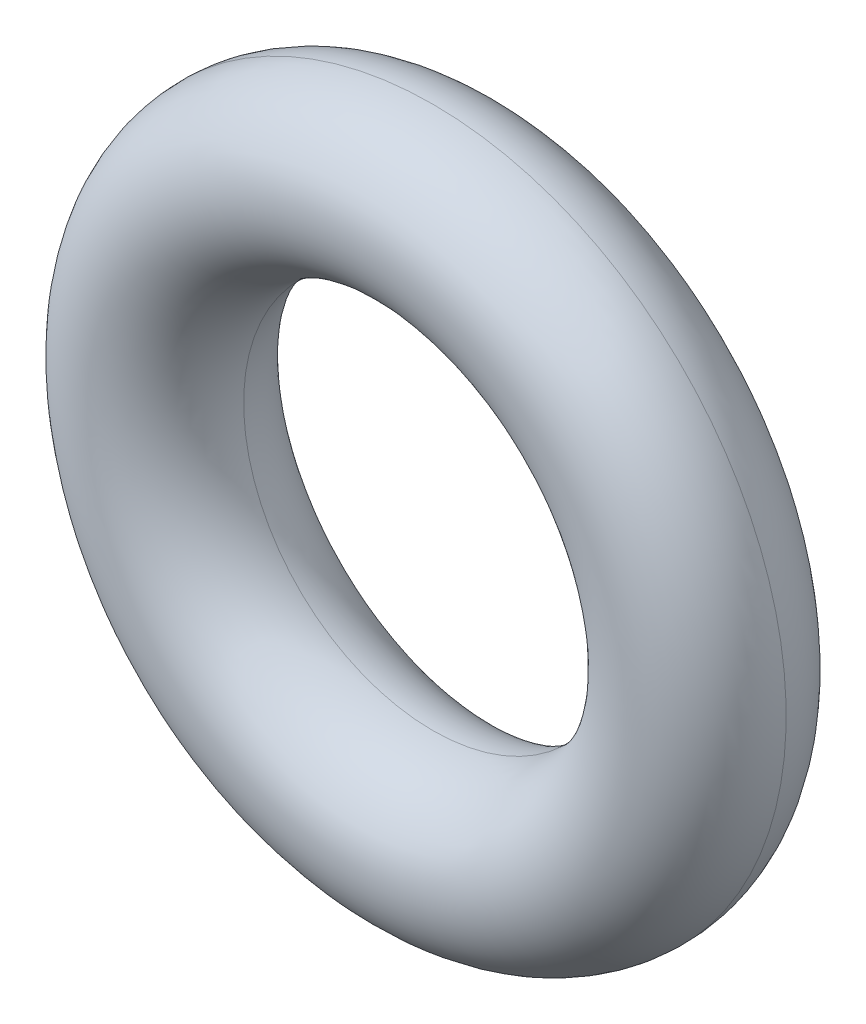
ISO-10303-21;
HEADER;
FILE_DESCRIPTION(('STEP AP214'),'2;1');
FILE_NAME('part.step','',(''),(''),'','','');
FILE_SCHEMA(('AUTOMOTIVE_DESIGN { 1 0 10303 214 1 1 1 1 }'));
ENDSEC;
DATA;
#1=APPLICATION_CONTEXT('core data for automotive mechanical design processes');
#2=APPLICATION_PROTOCOL_DEFINITION('international standard','automotive_design',2000,#1);
#3=PRODUCT_CONTEXT('',#1,'mechanical');
#4=PRODUCT('Part','Part','',(#3));
#5=PRODUCT_RELATED_PRODUCT_CATEGORY('part','',(#4));
#6=PRODUCT_DEFINITION_FORMATION('','',#4);
#7=PRODUCT_DEFINITION_CONTEXT('part definition',#1,'design');
#8=PRODUCT_DEFINITION('design','',#6,#7);
#9=PRODUCT_DEFINITION_SHAPE('','',#8);
#10=(LENGTH_UNIT() NAMED_UNIT(*) SI_UNIT(.MILLI.,.METRE.));
#11=(NAMED_UNIT(*) PLANE_ANGLE_UNIT() SI_UNIT($,.RADIAN.));
#12=(NAMED_UNIT(*) SI_UNIT($,.STERADIAN.) SOLID_ANGLE_UNIT());
#13=UNCERTAINTY_MEASURE_WITH_UNIT(LENGTH_MEASURE(1.E-05),#10,'distance_accuracy_value','');
#14=(GEOMETRIC_REPRESENTATION_CONTEXT(3) GLOBAL_UNCERTAINTY_ASSIGNED_CONTEXT((#13)) GLOBAL_UNIT_ASSIGNED_CONTEXT((#10,
#11,#12)) REPRESENTATION_CONTEXT('',''));
#15=CARTESIAN_POINT('',(0.,0.,0.));
#16=DIRECTION('',(0.,0.,1.));
#17=DIRECTION('',(1.,0.,0.));
#18=AXIS2_PLACEMENT_3D('',#15,#16,#17);
#19=CARTESIAN_POINT('',(0.,0.,2.667));
#20=DIRECTION('',(0.,0.,1.));
#21=DIRECTION('',(0.,-1.,0.));
#22=AXIS2_PLACEMENT_3D('',#19,#20,#21);
#23=TOROIDAL_SURFACE('',#22,8.8265,2.667);
#24=CARTESIAN_POINT('',(0.,0.,2.667));
#25=DIRECTION('',(0.,0.,1.));
#26=DIRECTION('',(0.,-1.,0.));
#27=AXIS2_PLACEMENT_3D('',#24,#25,#26);
#28=CIRCLE('',#27,6.1595);
#29=CARTESIAN_POINT('',(0.,-6.1595,2.667));
#30=VERTEX_POINT('',#29);
#31=EDGE_CURVE('E19',#30,#30,#28,.T.);
#32=ORIENTED_EDGE('',*,*,#31,.F.);
#33=EDGE_LOOP('',(#32));
#34=FACE_BOUND('',#33,.T.);
#35=CARTESIAN_POINT('',(0.,0.,2.667));
#36=DIRECTION('',(0.,0.,-1.));
#37=DIRECTION('',(0.,1.,0.));
#38=AXIS2_PLACEMENT_3D('',#35,#36,#37);
#39=CIRCLE('',#38,11.4935);
#40=CARTESIAN_POINT('',(0.,11.4935,2.667));
#41=VERTEX_POINT('',#40);
#42=EDGE_CURVE('E9',#41,#41,#39,.T.);
#43=ORIENTED_EDGE('',*,*,#42,.F.);
#44=EDGE_LOOP('',(#43));
#45=FACE_BOUND('',#44,.T.);
#46=ADVANCED_FACE('F13',(#34,#45),#23,.T.);
#47=ORIENTED_EDGE('',*,*,#42,.T.);
#48=EDGE_LOOP('',(#47));
#49=FACE_BOUND('',#48,.T.);
#50=ORIENTED_EDGE('',*,*,#31,.T.);
#51=EDGE_LOOP('',(#50));
#52=FACE_BOUND('',#51,.T.);
#53=ADVANCED_FACE('F15',(#49,#52),#23,.T.);
#54=CLOSED_SHELL('',(#46,#53));
#55=MANIFOLD_SOLID_BREP('B1',#54);
#56=ADVANCED_BREP_SHAPE_REPRESENTATION('',(#18,#55),#14);
#57=SHAPE_DEFINITION_REPRESENTATION(#9,#56);
ENDSEC;
END-ISO-10303-21;
